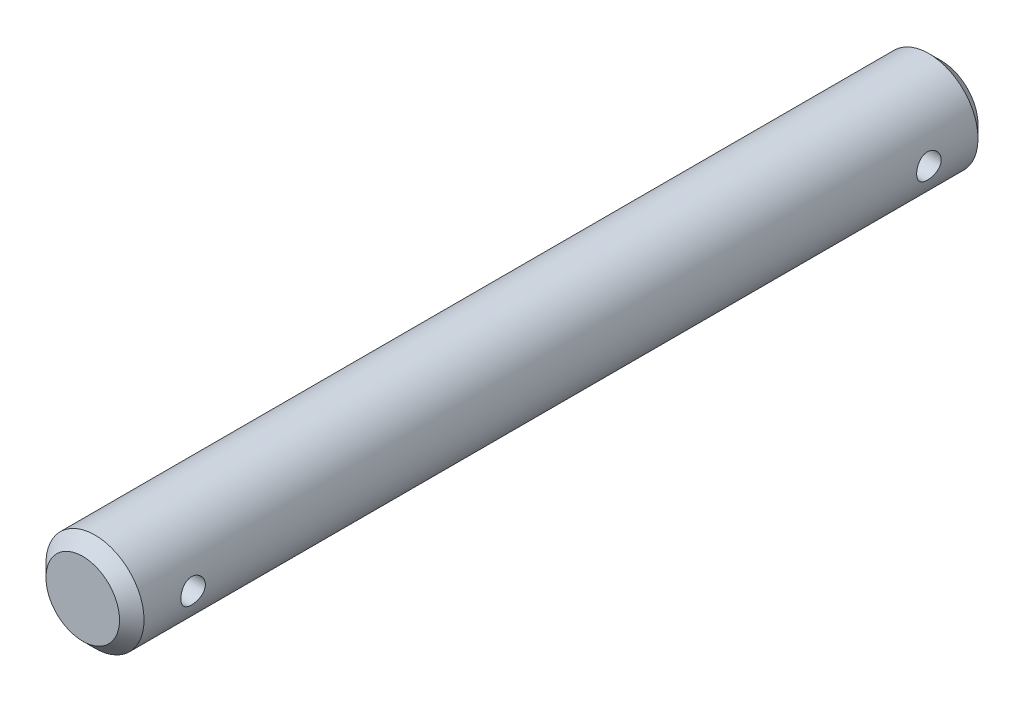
from build123d import *

# Parameters (mm, degrees)
ESQUISSE1_R                  = 4
EXTRUSION1_DEPTH             = 70
CHANFREIN1_SIZE              = 1
ENL_V_MAT_EXTRU_1_DEPTH      = 71.228199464
ENL_V_MAT_EXTRU_1_DEPTH_BACK = 71.228199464
ESQUISSE2_R                  = 1


with BuildPart() as part:
    # Esquisse1 → Extrusion1 (new body)
    with BuildSketch(Plane.XY):
        Circle(ESQUISSE1_R)
    extrude(amount=EXTRUSION1_DEPTH)

    # Chanfrein1
    chanfrein1_edges = [part.edges().sort_by_distance(p)[0] for p in [
        (-4, 0, 0),
        (-4, 0, 70),
    ]]
    chamfer(chanfrein1_edges, length=CHANFREIN1_SIZE)

    # Esquisse2 → Enl_v. mat.-Extru.1 (cut, two sides: drawn at the far end of the back side and taken through both)
    with BuildSketch(Plane(origin=(0, 0, 0), x_dir=(0, 0, -1), z_dir=(1, 0, 0)).offset(-ENL_V_MAT_EXTRU_1_DEPTH_BACK)):
        with Locations(Location((-65, 0, 0), (0, 0, 180))):
            Circle(ESQUISSE2_R)
        with Locations(Location((-5, 0, 0), (0, 0, 180))):
            Circle(ESQUISSE2_R)
    extrude(amount=ENL_V_MAT_EXTRU_1_DEPTH + ENL_V_MAT_EXTRU_1_DEPTH_BACK, mode=Mode.SUBTRACT)


solid = part.part
